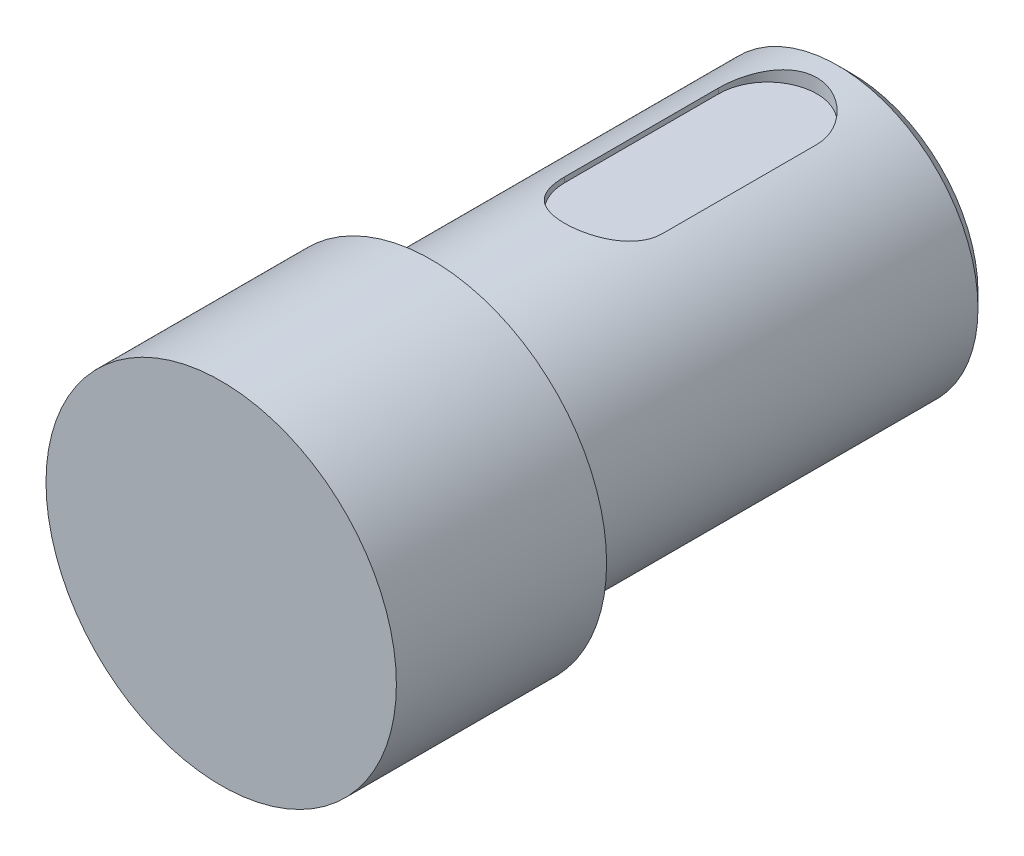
from build123d import *

# Parameters (mm, degrees)
SKETCH1_R           = 20
EXTRUDE1_DEPTH      = 60
SKETCH2_R           = 25
EXTRUDE2_DEPTH      = 30
CUT_EXTRUDE_1_DEPTH = 2
CHAMFER_1_SIZE      = 2


with BuildPart() as part:
    # Sketch1 → Extrude1 (new body)
    with BuildSketch(Plane.XY):
        Circle(SKETCH1_R)
    extrude(amount=EXTRUDE1_DEPTH)

    # Sketch2 → Extrude2 (add)
    with BuildSketch(Plane.XY.offset(60)):
        Circle(SKETCH2_R)
    extrude(amount=EXTRUDE2_DEPTH)

    # Sketch 1 → Cut-Extrude 1 (cut)
    with BuildSketch(Plane(origin=(0, 20, 0), x_dir=(-1, 0, 0), z_dir=(0, 1, 0))):
        with BuildLine():
            Line((-7, 34), (-7, 12))
            ThreePointArc((-7, 12), (0, 5), (7, 12))
            Line((7, 12), (7, 34))
            ThreePointArc((7, 34), (0, 41), (-7, 34))
        make_face()
    extrude(amount=-CUT_EXTRUDE_1_DEPTH, mode=Mode.SUBTRACT)

    # Chamfer 1
    chamfer_1_edges = [part.edges().sort_by_distance(p)[0] for p in [
        (-20, 0, 0),
    ]]
    chamfer(chamfer_1_edges, length=CHAMFER_1_SIZE)


solid = part.part
